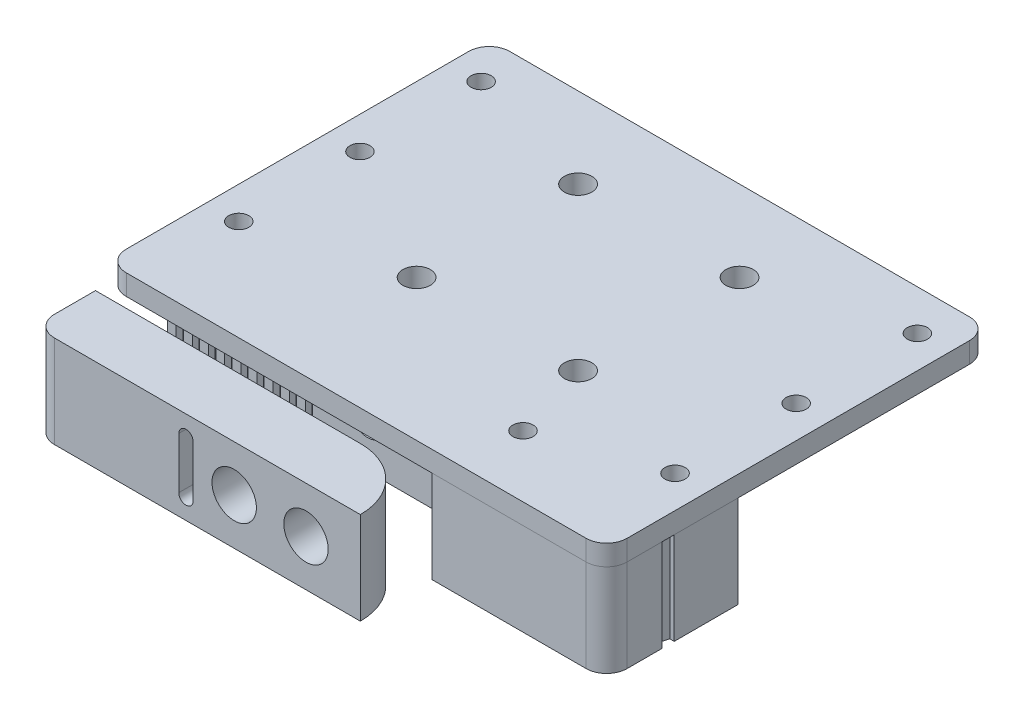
from build123d import *

# Parameters (mm, degrees)
SKETCH1_R                           = 1.7
SKETCH1_R_2                         = 1.25
BOSS_EXTRUDE1_DEPTH                 = 2.54
SKETCH2_R                           = 1.25
BOSS_EXTRUDE2_DEPTH                 = 11.43
BOSS_EXTRUDE3_DEPTH                 = 11.43
CUT_EXTRUDE1_DEPTH                  = 7.62
F_5_5_5_5_DIAMETER_HOLE1_AT_2_COUNT = 2
F_5_5_5_5_DIAMETER_HOLE1_AT_2_PITCH = 8.89
SKETCH8_W                           = 2.1
SKETCH8_H                           = 39.8501
F_4_2_4_2_DIAMETER_HOLE1_AT_2_COUNT = 2
F_4_2_4_2_DIAMETER_HOLE1_AT_2_PITCH = 8.89
SKETCH10_W                          = 1.25
SKETCH10_H                          = 13.97


with BuildPart() as part:
    # Sketch1 → Boss-Extrude1 (new body)
    with BuildSketch(Plane(origin=(0, 0, 0), x_dir=(1, 0, 0), z_dir=(0, 1, 0))):
        with BuildLine():
            Line((-31, -17.46), (-31, 17.46))
            ThreePointArc((-31, 17.46), (-30.256051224, 19.256051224), (-28.46, 20))
            Line((-28.46, 20), (28.46, 20))
            ThreePointArc((28.46, 20), (30.256051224, 19.256051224), (31, 17.46))
            Line((31, 17.46), (31, -17.46))
            Line((31, -17.46), (31, -24.9301))
            ThreePointArc((31, -24.9301), (30.256051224, -26.726151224), (28.46, -27.4701))
            Line((28.46, -27.4701), (-28.46, -27.4701))
            ThreePointArc((-28.46, -27.4701), (-30.256051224, -26.726151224), (-31, -24.9301))
            Line((-31, -24.9301), (-31, -17.46))
        make_face()
        with Locations(Location((-9.9949, 9.9949, 0), (0, 0, 270))):
            Circle(SKETCH1_R, mode=Mode.SUBTRACT)
        with Locations(Location((9.9949, 9.9949, 0), (0, 0, 270))):
            Circle(SKETCH1_R, mode=Mode.SUBTRACT)
        with Locations(Location((9.9949, -9.9949, 0), (0, 0, 270))):
            Circle(SKETCH1_R, mode=Mode.SUBTRACT)
        with Locations(Location((-9.9949, -9.9949, 0), (0, 0, 270))):
            Circle(SKETCH1_R, mode=Mode.SUBTRACT)
        with Locations(Location((-27, 0, 0), (0, 0, 270))):
            Circle(SKETCH1_R_2, mode=Mode.SUBTRACT)
        with Locations(Location((-27, -15, 0), (0, 0, 270))):
            Circle(SKETCH1_R_2, mode=Mode.SUBTRACT)
        with Locations(Location((-27, 15, 0), (0, 0, 90))):
            Circle(SKETCH1_R_2, mode=Mode.SUBTRACT)
        with Locations(Location((27, 15, 0), (0, 0, 270))):
            Circle(SKETCH1_R_2, mode=Mode.SUBTRACT)
        with Locations(Location((27, 0, 0), (0, 0, 90))):
            Circle(SKETCH1_R_2, mode=Mode.SUBTRACT)
        with Locations(Location((27, -15, 0), (0, 0, 90))):
            Circle(SKETCH1_R_2, mode=Mode.SUBTRACT)
    extrude(amount=BOSS_EXTRUDE1_DEPTH)


with BuildPart() as body_2:
    # Sketch2 → Boss-Extrude2 (new body)
    with BuildSketch(Plane.XZ):
        with BuildLine():
            Line((23.635, 11.19), (31, 11.19))
            Line((31, 11.19), (31, 14.7701))
            Line((31, 14.7701), (31, 19.1001))
            Line((31, 19.1001), (30.45, 19.1001))
            Line((30.45, 19.1001), (30.25, 19.8501))
            Line((30.25, 19.8501), (29.75, 19.8501))
            Line((29.75, 19.8501), (29.55, 19.1001))
            Line((29.55, 19.1001), (28.45, 19.1001))
            Line((28.45, 19.1001), (28.25, 19.8501))
            Line((28.25, 19.8501), (27.75, 19.8501))
            Line((27.75, 19.8501), (27.55, 19.1001))
            Line((27.55, 19.1001), (26.45, 19.1001))
            Line((26.45, 19.1001), (26.25, 19.8501))
            Line((26.25, 19.8501), (25.75, 19.8501))
            Line((25.75, 19.8501), (25.55, 19.1001))
            Line((25.55, 19.1001), (24.45, 19.1001))
            Line((24.45, 19.1001), (24.25, 19.8501))
            Line((24.25, 19.8501), (23.75, 19.8501))
            Line((23.75, 19.8501), (23.55, 19.1001))
            Line((23.55, 19.1001), (23.38, 19.1001))
            ThreePointArc((23.38, 19.1001), (22.915104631, 19.118665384), (22.453170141, 19.174243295))
            Line((22.453170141, 19.174243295), (22.43478717, 19.950234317))
            Line((22.43478717, 19.950234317), (21.948754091, 20.067587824))
            Line((21.948754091, 20.067587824), (21.578310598, 19.385479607))
            ThreePointArc((21.578310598, 19.385479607), (21.498241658, 19.41213973), (21.418567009, 19.439956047))
            ThreePointArc((21.418567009, 19.439956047), (20.987018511, 19.613847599), (20.570710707, 19.821597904))
            Line((20.570710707, 19.821597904), (20.814472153, 20.558537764))
            Line((20.814472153, 20.558537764), (20.396254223, 20.832570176))
            Line((20.396254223, 20.832570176), (19.817918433, 20.314856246))
            ThreePointArc((19.817918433, 20.314856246), (19.751486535, 20.366900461), (19.685814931, 20.419900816))
            ThreePointArc((19.685814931, 20.419900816), (19.337926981, 20.728844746), (19.015782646, 21.064546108))
            Line((19.015782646, 21.064546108), (19.493268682, 21.676515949))
            Line((19.493268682, 21.676515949), (19.191625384, 22.075278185))
            Line((19.191625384, 22.075278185), (18.472824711, 21.782318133))
            ThreePointArc((18.472824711, 21.782318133), (18.427775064, 21.853678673), (18.383763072, 21.925683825))
            ThreePointArc((18.383763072, 21.925683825), (18.160095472, 22.333660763), (17.969672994, 22.758174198))
            Line((17.969672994, 22.758174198), (18.625214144, 23.173825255))
            Line((18.625214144, 23.173825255), (18.475313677, 23.650826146))
            Line((18.475313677, 23.650826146), (17.699852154, 23.616775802))
            ThreePointArc((17.699852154, 23.616775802), (17.587584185, 24.269177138), (17.55, 24.9301))
            ThreePointArc((17.55, 24.9301), (18.3, 25.6801), (19.05, 24.9301))
            ThreePointArc((19.05, 24.9301), (20.318227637, 21.868327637), (23.38, 20.6001))
            Line((23.38, 20.6001), (31, 20.6001))
            Line((31, 20.6001), (31, 24.9301))
            ThreePointArc((31, 24.9301), (30.256051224, 26.726151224), (28.46, 27.4701))
            Line((28.46, 27.4701), (9.41, 27.4701))
            ThreePointArc((9.41, 27.4701), (7.178153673, 22.081946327), (1.79, 19.8501))
            Line((1.79, 19.8501), (-7, 19.8501))
            Line((-7, 19.8501), (-11.9, 19.8501))
            Line((-11.9, 19.8501), (-13, 19.8501))
            Line((-13, 19.8501), (-13.075, 19.1001))
            Line((-13.075, 19.1001), (-13.825, 19.1001))
            Line((-13.825, 19.1001), (-13.9, 19.8501))
            Line((-13.9, 19.8501), (-15, 19.8501))
            Line((-15, 19.8501), (-15.075, 19.1001))
            Line((-15.075, 19.1001), (-15.825, 19.1001))
            Line((-15.825, 19.1001), (-15.9, 19.8501))
            Line((-15.9, 19.8501), (-17, 19.8501))
            Line((-17, 19.8501), (-17.075, 19.1001))
            Line((-17.075, 19.1001), (-17.825, 19.1001))
            Line((-17.825, 19.1001), (-17.9, 19.8501))
            Line((-17.9, 19.8501), (-19, 19.8501))
            Line((-19, 19.8501), (-19.075, 19.1001))
            Line((-19.075, 19.1001), (-19.825, 19.1001))
            Line((-19.825, 19.1001), (-19.9, 19.8501))
            Line((-19.9, 19.8501), (-21, 19.8501))
            Line((-21, 19.8501), (-21.075, 19.1001))
            Line((-21.075, 19.1001), (-21.825, 19.1001))
            Line((-21.825, 19.1001), (-21.9, 19.8501))
            Line((-21.9, 19.8501), (-23, 19.8501))
            Line((-23, 19.8501), (-23.075, 19.1001))
            Line((-23.075, 19.1001), (-23.825, 19.1001))
            Line((-23.825, 19.1001), (-23.9, 19.8501))
            Line((-23.9, 19.8501), (-25, 19.8501))
            Line((-25, 19.8501), (-25.075, 19.1001))
            Line((-25.075, 19.1001), (-25.825, 19.1001))
            Line((-25.825, 19.1001), (-25.9, 19.8501))
            Line((-25.9, 19.8501), (-27, 19.8501))
            Line((-27, 19.8501), (-27.075, 19.1001))
            Line((-27.075, 19.1001), (-27.825, 19.1001))
            Line((-27.825, 19.1001), (-27.9, 19.8501))
            Line((-27.9, 19.8501), (-29, 19.8501))
            Line((-29, 19.8501), (-29.075, 19.1001))
            Line((-29.075, 19.1001), (-29.825, 19.1001))
            Line((-29.825, 19.1001), (-29.9, 19.8501))
            Line((-29.9, 19.8501), (-31, 19.8501))
            Line((-31, 19.8501), (-31, 14.7701))
            Line((-31, 14.7701), (-31, 11.19))
            Line((-31, 11.19), (-23.635, 11.19))
            Line((-23.635, 11.19), (-23.635, 14.7701))
            Line((-23.635, 14.7701), (23.635, 14.7701))
            Line((23.635, 14.7701), (23.635, 11.19))
        make_face()
        with Locations((-27, 15)):
            Circle(SKETCH2_R, mode=Mode.SUBTRACT)
        with Locations((27, 15)):
            Circle(SKETCH2_R, mode=Mode.SUBTRACT)
    extrude(amount=BOSS_EXTRUDE2_DEPTH)

    # Sketch8 → 4.2 _4.2_ Diameter Hole1 (revolve, cut)
    with BuildSketch(Plane(origin=(-6.211, -5.715, 19.8501), x_dir=(0, -1, 0), z_dir=(1, 0, 0))):
        with Locations((1.05, 19.92505)):
            Rectangle(SKETCH8_W, SKETCH8_H)
    f_4_2_4_2_diameter_hole1 = revolve(axis=Axis((-6.211, -5.715, 26.2001), (0, 0, -1)), mode=Mode.SUBTRACT)

    # 4.2 _4.2_ Diameter Hole1 at 2: 4.2 _4.2_ Diameter Hole1 ×2
    with Locations(*[(i * F_4_2_4_2_DIAMETER_HOLE1_AT_2_PITCH, 0, 0) for i in range(1, F_4_2_4_2_DIAMETER_HOLE1_AT_2_COUNT)]):
        add(f_4_2_4_2_diameter_hole1, mode=Mode.SUBTRACT)


with BuildPart() as body_3:
    # Sketch3 → Boss-Extrude3 (new body)
    with BuildSketch(Plane(origin=(0, 0, 0), x_dir=(-1, 0, 0), z_dir=(0, -1, 0))):
        with BuildLine():
            Line((28.46, -36.3601), (-9.41, -36.3601))
            ThreePointArc((-9.41, -36.3601), (-7.178153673, -30.971946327), (-1.79, -28.7401))
            Line((-1.79, -28.7401), (7, -28.7401))
            Line((7, -28.7401), (31, -28.7401))
            Line((31, -28.7401), (31, -33.8201))
            ThreePointArc((31, -33.8201), (30.256051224, -35.616151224), (28.46, -36.3601))
        make_face()
    extrude(amount=BOSS_EXTRUDE3_DEPTH)

    # Sketch4 → Cut-Extrude1 (cut)
    with BuildSketch(Plane.XY.offset(36.3601)):
        with BuildLine():
            Line((-11.291, -2.54), (-11.291, -8.89))
            ThreePointArc((-11.291, -8.89), (-12.18, -9.779), (-13.069, -8.89))
            Line((-13.069, -8.89), (-13.069, -2.54))
            ThreePointArc((-13.069, -2.54), (-12.18, -1.651), (-11.291, -2.54))
        make_face()
    extrude(amount=-CUT_EXTRUDE1_DEPTH, mode=Mode.SUBTRACT)

    # Sketch6 → 5.5 _5.5_ Diameter Hole1 (revolve, cut)
    with BuildSketch(Plane(origin=(-6.211, -5.715, 36.3601), x_dir=(0, -1, 0), z_dir=(1, 0, 0))):
        Polygon((0, 0), (0, 9.272366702), (2.75, 7.62), (2.75, 0), align=None)
    f_5_5_5_5_diameter_hole1 = revolve(axis=Axis((-6.211, -5.715, 42.7101), (0, 0, -1)), mode=Mode.SUBTRACT)

    # 5.5 _5.5_ Diameter Hole1 at 2: 5.5 _5.5_ Diameter Hole1 ×2
    with Locations(*[(i * F_5_5_5_5_DIAMETER_HOLE1_AT_2_PITCH, 0, 0) for i in range(1, F_5_5_5_5_DIAMETER_HOLE1_AT_2_COUNT)]):
        add(f_5_5_5_5_diameter_hole1, mode=Mode.SUBTRACT)


with BuildPart() as f_2_5_2_5_diameter_hole1_tool:
    # Sketch10 → 2.5 _2.5_ Diameter Hole1 (revolve)
    with BuildSketch(Plane(origin=(13.031881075, -11.43, 19.8501), x_dir=(0, 0, -1), z_dir=(1, 0, 0))):
        with Locations((0.625, 6.985)):
            Rectangle(SKETCH10_W, SKETCH10_H)
    revolve(axis=Axis((13.031881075, -17.78, 19.8501), (0, 1, 0)))


with BuildPart() as part_1:
    add(part.part)

    # 2.5 _2.5_ Diameter Hole1: cut by f_2_5_2_5_diameter_hole1_tool
    add(f_2_5_2_5_diameter_hole1_tool.part, mode=Mode.SUBTRACT)


with BuildPart() as body_2_1:
    add(body_2.part)

    # 2.5 _2.5_ Diameter Hole1: cut by f_2_5_2_5_diameter_hole1_tool
    add(f_2_5_2_5_diameter_hole1_tool.part, mode=Mode.SUBTRACT)


solid = Compound([body_3.part, part_1.part, body_2_1.part])
